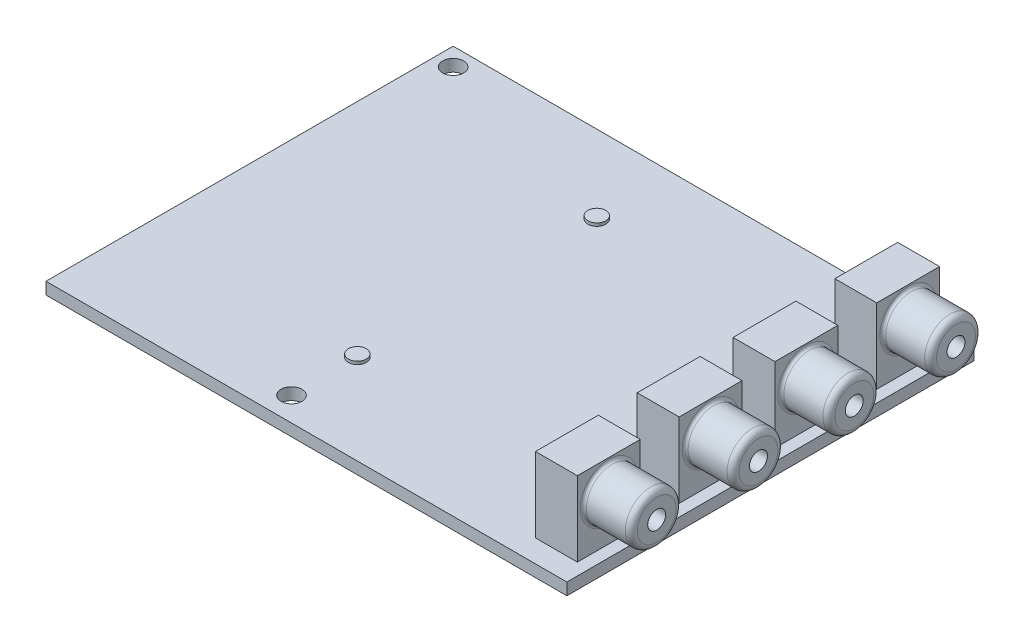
ISO-10303-21;
HEADER;
FILE_DESCRIPTION(('STEP AP214'),'2;1');
FILE_NAME('part.step','',(''),(''),'','','');
FILE_SCHEMA(('AUTOMOTIVE_DESIGN { 1 0 10303 214 1 1 1 1 }'));
ENDSEC;
DATA;
#1=APPLICATION_CONTEXT('core data for automotive mechanical design processes');
#2=APPLICATION_PROTOCOL_DEFINITION('international standard','automotive_design',2000,#1);
#3=PRODUCT_CONTEXT('',#1,'mechanical');
#4=PRODUCT('Part','Part','',(#3));
#5=PRODUCT_RELATED_PRODUCT_CATEGORY('part','',(#4));
#6=PRODUCT_DEFINITION_FORMATION('','',#4);
#7=PRODUCT_DEFINITION_CONTEXT('part definition',#1,'design');
#8=PRODUCT_DEFINITION('design','',#6,#7);
#9=PRODUCT_DEFINITION_SHAPE('','',#8);
#10=(LENGTH_UNIT() NAMED_UNIT(*) SI_UNIT(.MILLI.,.METRE.));
#11=(NAMED_UNIT(*) PLANE_ANGLE_UNIT() SI_UNIT($,.RADIAN.));
#12=(NAMED_UNIT(*) SI_UNIT($,.STERADIAN.) SOLID_ANGLE_UNIT());
#13=UNCERTAINTY_MEASURE_WITH_UNIT(LENGTH_MEASURE(1.E-05),#10,'distance_accuracy_value','');
#14=(GEOMETRIC_REPRESENTATION_CONTEXT(3) GLOBAL_UNCERTAINTY_ASSIGNED_CONTEXT((#13)) GLOBAL_UNIT_ASSIGNED_CONTEXT((#10,
#11,#12)) REPRESENTATION_CONTEXT('',''));
#15=CARTESIAN_POINT('',(0.,0.,0.));
#16=DIRECTION('',(0.,0.,1.));
#17=DIRECTION('',(1.,0.,0.));
#18=AXIS2_PLACEMENT_3D('',#15,#16,#17);
#19=CARTESIAN_POINT('',(0.,2.,0.));
#20=DIRECTION('',(0.,-1.,0.));
#21=DIRECTION('',(0.,0.,-1.));
#22=AXIS2_PLACEMENT_3D('',#19,#20,#21);
#23=PLANE('',#22);
#24=CARTESIAN_POINT('',(37.,2.,-15.));
#25=DIRECTION('',(0.,-1.,0.));
#26=DIRECTION('',(0.,0.,-1.));
#27=AXIS2_PLACEMENT_3D('',#24,#25,#26);
#28=CIRCLE('',#27,1.5);
#29=CARTESIAN_POINT('',(37.,2.,-16.5));
#30=VERTEX_POINT('',#29);
#31=EDGE_CURVE('E11',#30,#30,#28,.F.);
#32=ORIENTED_EDGE('',*,*,#31,.F.);
#33=EDGE_LOOP('',(#32));
#34=FACE_BOUND('',#33,.T.);
#35=CARTESIAN_POINT('',(37.,2.,-55.));
#36=DIRECTION('',(0.,-1.,0.));
#37=DIRECTION('',(0.,0.,-1.));
#38=AXIS2_PLACEMENT_3D('',#35,#36,#37);
#39=CIRCLE('',#38,1.5);
#40=CARTESIAN_POINT('',(37.,2.,-56.5));
#41=VERTEX_POINT('',#40);
#42=EDGE_CURVE('E47',#41,#41,#39,.F.);
#43=ORIENTED_EDGE('',*,*,#42,.F.);
#44=EDGE_LOOP('',(#43));
#45=FACE_BOUND('',#44,.T.);
#46=DIRECTION('',(0.,0.,-1.));
#47=VECTOR('',#46,1.);
#48=CARTESIAN_POINT('',(85.,2.,-31.25));
#49=LINE('',#48,#47);
#50=CARTESIAN_POINT('',(85.,2.,-20.75));
#51=VERTEX_POINT('',#50);
#52=CARTESIAN_POINT('',(85.,2.,-31.25));
#53=VERTEX_POINT('',#52);
#54=EDGE_CURVE('E229',#51,#53,#49,.T.);
#55=ORIENTED_EDGE('',*,*,#54,.F.);
#56=DIRECTION('',(1.,0.,0.));
#57=VECTOR('',#56,1.);
#58=CARTESIAN_POINT('',(78.,2.,-20.75));
#59=LINE('',#58,#57);
#60=CARTESIAN_POINT('',(78.,2.,-20.75));
#61=VERTEX_POINT('',#60);
#62=EDGE_CURVE('E219',#61,#51,#59,.T.);
#63=ORIENTED_EDGE('',*,*,#62,.F.);
#64=DIRECTION('',(0.,0.,1.));
#65=VECTOR('',#64,1.);
#66=CARTESIAN_POINT('',(78.,2.,-31.25));
#67=LINE('',#66,#65);
#68=CARTESIAN_POINT('',(78.,2.,-31.25));
#69=VERTEX_POINT('',#68);
#70=EDGE_CURVE('E222',#69,#61,#67,.T.);
#71=ORIENTED_EDGE('',*,*,#70,.F.);
#72=DIRECTION('',(-1.,0.,0.));
#73=VECTOR('',#72,1.);
#74=CARTESIAN_POINT('',(78.,2.,-31.25));
#75=LINE('',#74,#73);
#76=EDGE_CURVE('E226',#53,#69,#75,.T.);
#77=ORIENTED_EDGE('',*,*,#76,.F.);
#78=EDGE_LOOP('',(#55,#63,#71,#77));
#79=FACE_BOUND('',#78,.T.);
#80=DIRECTION('',(0.,0.,-1.));
#81=VECTOR('',#80,1.);
#82=CARTESIAN_POINT('',(85.,2.,-64.25));
#83=LINE('',#82,#81);
#84=CARTESIAN_POINT('',(85.,2.,-53.75));
#85=VERTEX_POINT('',#84);
#86=CARTESIAN_POINT('',(85.,2.,-64.25));
#87=VERTEX_POINT('',#86);
#88=EDGE_CURVE('E265',#85,#87,#83,.T.);
#89=ORIENTED_EDGE('',*,*,#88,.F.);
#90=DIRECTION('',(1.,0.,0.));
#91=VECTOR('',#90,1.);
#92=CARTESIAN_POINT('',(78.,2.,-53.75));
#93=LINE('',#92,#91);
#94=CARTESIAN_POINT('',(78.,2.,-53.75));
#95=VERTEX_POINT('',#94);
#96=EDGE_CURVE('E277',#95,#85,#93,.T.);
#97=ORIENTED_EDGE('',*,*,#96,.F.);
#98=DIRECTION('',(0.,0.,1.));
#99=VECTOR('',#98,1.);
#100=CARTESIAN_POINT('',(78.,2.,-64.25));
#101=LINE('',#100,#99);
#102=CARTESIAN_POINT('',(78.,2.,-64.25));
#103=VERTEX_POINT('',#102);
#104=EDGE_CURVE('E289',#103,#95,#101,.T.);
#105=ORIENTED_EDGE('',*,*,#104,.F.);
#106=DIRECTION('',(-1.,0.,0.));
#107=VECTOR('',#106,1.);
#108=CARTESIAN_POINT('',(78.,2.,-64.25));
#109=LINE('',#108,#107);
#110=EDGE_CURVE('E286',#87,#103,#109,.T.);
#111=ORIENTED_EDGE('',*,*,#110,.F.);
#112=EDGE_LOOP('',(#89,#97,#105,#111));
#113=FACE_BOUND('',#112,.T.);
#114=DIRECTION('',(0.,0.,1.));
#115=VECTOR('',#114,1.);
#116=CARTESIAN_POINT('',(0.,2.,0.));
#117=LINE('',#116,#115);
#118=CARTESIAN_POINT('',(0.,2.,-68.));
#119=VERTEX_POINT('',#118);
#120=CARTESIAN_POINT('',(0.,2.,0.));
#121=VERTEX_POINT('',#120);
#122=EDGE_CURVE('E330',#119,#121,#117,.T.);
#123=ORIENTED_EDGE('',*,*,#122,.T.);
#124=DIRECTION('',(1.,0.,0.));
#125=VECTOR('',#124,1.);
#126=CARTESIAN_POINT('',(0.,2.,0.));
#127=LINE('',#126,#125);
#128=CARTESIAN_POINT('',(87.,2.,0.));
#129=VERTEX_POINT('',#128);
#130=EDGE_CURVE('E333',#121,#129,#127,.T.);
#131=ORIENTED_EDGE('',*,*,#130,.T.);
#132=DIRECTION('',(0.,0.,-1.));
#133=VECTOR('',#132,1.);
#134=CARTESIAN_POINT('',(87.,2.,0.));
#135=LINE('',#134,#133);
#136=CARTESIAN_POINT('',(87.,2.,-68.));
#137=VERTEX_POINT('',#136);
#138=EDGE_CURVE('E336',#129,#137,#135,.T.);
#139=ORIENTED_EDGE('',*,*,#138,.T.);
#140=DIRECTION('',(-1.,0.,0.));
#141=VECTOR('',#140,1.);
#142=CARTESIAN_POINT('',(0.,2.,-68.));
#143=LINE('',#142,#141);
#144=EDGE_CURVE('E338',#137,#119,#143,.T.);
#145=ORIENTED_EDGE('',*,*,#144,.T.);
#146=EDGE_LOOP('',(#123,#131,#139,#145));
#147=FACE_BOUND('',#146,.T.);
#148=CARTESIAN_POINT('',(3.,2.,-65.));
#149=DIRECTION('',(0.,1.,0.));
#150=DIRECTION('',(0.,0.,1.));
#151=AXIS2_PLACEMENT_3D('',#148,#149,#150);
#152=CIRCLE('',#151,1.75);
#153=CARTESIAN_POINT('',(3.,2.,-63.25));
#154=VERTEX_POINT('',#153);
#155=EDGE_CURVE('E324',#154,#154,#152,.T.);
#156=ORIENTED_EDGE('',*,*,#155,.F.);
#157=EDGE_LOOP('',(#156));
#158=FACE_BOUND('',#157,.T.);
#159=CARTESIAN_POINT('',(37.,2.,-4.));
#160=DIRECTION('',(0.,1.,0.));
#161=DIRECTION('',(0.,0.,1.));
#162=AXIS2_PLACEMENT_3D('',#159,#160,#161);
#163=CIRCLE('',#162,1.75);
#164=CARTESIAN_POINT('',(37.,2.,-2.25));
#165=VERTEX_POINT('',#164);
#166=EDGE_CURVE('E318',#165,#165,#163,.T.);
#167=ORIENTED_EDGE('',*,*,#166,.F.);
#168=EDGE_LOOP('',(#167));
#169=FACE_BOUND('',#168,.T.);
#170=CARTESIAN_POINT('',(73.,2.,-51.));
#171=DIRECTION('',(0.,1.,0.));
#172=DIRECTION('',(0.,0.,1.));
#173=AXIS2_PLACEMENT_3D('',#170,#171,#172);
#174=CIRCLE('',#173,1.75);
#175=CARTESIAN_POINT('',(73.,2.,-49.25));
#176=VERTEX_POINT('',#175);
#177=EDGE_CURVE('E312',#176,#176,#174,.T.);
#178=ORIENTED_EDGE('',*,*,#177,.F.);
#179=EDGE_LOOP('',(#178));
#180=FACE_BOUND('',#179,.T.);
#181=CARTESIAN_POINT('',(73.,2.,-17.));
#182=DIRECTION('',(0.,1.,0.));
#183=DIRECTION('',(0.,0.,1.));
#184=AXIS2_PLACEMENT_3D('',#181,#182,#183);
#185=CIRCLE('',#184,1.75);
#186=CARTESIAN_POINT('',(73.,2.,-15.25));
#187=VERTEX_POINT('',#186);
#188=EDGE_CURVE('E306',#187,#187,#185,.T.);
#189=ORIENTED_EDGE('',*,*,#188,.F.);
#190=EDGE_LOOP('',(#189));
#191=FACE_BOUND('',#190,.T.);
#192=DIRECTION('',(0.,0.,-1.));
#193=VECTOR('',#192,1.);
#194=CARTESIAN_POINT('',(85.,2.,-47.25));
#195=LINE('',#194,#193);
#196=CARTESIAN_POINT('',(85.,2.,-36.75));
#197=VERTEX_POINT('',#196);
#198=CARTESIAN_POINT('',(85.,2.,-47.25));
#199=VERTEX_POINT('',#198);
#200=EDGE_CURVE('E262',#197,#199,#195,.T.);
#201=ORIENTED_EDGE('',*,*,#200,.F.);
#202=DIRECTION('',(1.,0.,0.));
#203=VECTOR('',#202,1.);
#204=CARTESIAN_POINT('',(78.,2.,-36.75));
#205=LINE('',#204,#203);
#206=CARTESIAN_POINT('',(78.,2.,-36.75));
#207=VERTEX_POINT('',#206);
#208=EDGE_CURVE('E252',#207,#197,#205,.T.);
#209=ORIENTED_EDGE('',*,*,#208,.F.);
#210=DIRECTION('',(0.,0.,1.));
#211=VECTOR('',#210,1.);
#212=CARTESIAN_POINT('',(78.,2.,-47.25));
#213=LINE('',#212,#211);
#214=CARTESIAN_POINT('',(78.,2.,-47.25));
#215=VERTEX_POINT('',#214);
#216=EDGE_CURVE('E255',#215,#207,#213,.T.);
#217=ORIENTED_EDGE('',*,*,#216,.F.);
#218=DIRECTION('',(-1.,0.,0.));
#219=VECTOR('',#218,1.);
#220=CARTESIAN_POINT('',(78.,2.,-47.25));
#221=LINE('',#220,#219);
#222=EDGE_CURVE('E259',#199,#215,#221,.T.);
#223=ORIENTED_EDGE('',*,*,#222,.F.);
#224=EDGE_LOOP('',(#201,#209,#217,#223));
#225=FACE_BOUND('',#224,.T.);
#226=DIRECTION('',(0.,0.,-1.));
#227=VECTOR('',#226,1.);
#228=CARTESIAN_POINT('',(85.,2.,-14.25));
#229=LINE('',#228,#227);
#230=CARTESIAN_POINT('',(85.,2.,-3.75000000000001));
#231=VERTEX_POINT('',#230);
#232=CARTESIAN_POINT('',(85.,2.,-14.25));
#233=VERTEX_POINT('',#232);
#234=EDGE_CURVE('E172',#231,#233,#229,.T.);
#235=ORIENTED_EDGE('',*,*,#234,.F.);
#236=DIRECTION('',(1.,0.,0.));
#237=VECTOR('',#236,1.);
#238=CARTESIAN_POINT('',(78.,2.,-3.75000000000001));
#239=LINE('',#238,#237);
#240=CARTESIAN_POINT('',(78.,2.,-3.75000000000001));
#241=VERTEX_POINT('',#240);
#242=EDGE_CURVE('E174',#241,#231,#239,.T.);
#243=ORIENTED_EDGE('',*,*,#242,.F.);
#244=DIRECTION('',(0.,0.,1.));
#245=VECTOR('',#244,1.);
#246=CARTESIAN_POINT('',(78.,2.,-14.25));
#247=LINE('',#246,#245);
#248=CARTESIAN_POINT('',(78.,2.,-14.25));
#249=VERTEX_POINT('',#248);
#250=EDGE_CURVE('E59',#249,#241,#247,.T.);
#251=ORIENTED_EDGE('',*,*,#250,.F.);
#252=DIRECTION('',(-1.,0.,0.));
#253=VECTOR('',#252,1.);
#254=CARTESIAN_POINT('',(78.,2.,-14.25));
#255=LINE('',#254,#253);
#256=EDGE_CURVE('E54',#233,#249,#255,.T.);
#257=ORIENTED_EDGE('',*,*,#256,.F.);
#258=EDGE_LOOP('',(#235,#243,#251,#257));
#259=FACE_BOUND('',#258,.T.);
#260=ADVANCED_FACE('F39',(#34,#45,#79,#113,#147,#158,#169,#180,#191,#225,#259),#23,.F.);
#261=CARTESIAN_POINT('',(0.,0.,0.));
#262=DIRECTION('',(0.,-1.,0.));
#263=DIRECTION('',(0.,0.,-1.));
#264=AXIS2_PLACEMENT_3D('',#261,#262,#263);
#265=PLANE('',#264);
#266=CARTESIAN_POINT('',(73.,0.,-51.));
#267=DIRECTION('',(0.,1.,0.));
#268=DIRECTION('',(0.,0.,1.));
#269=AXIS2_PLACEMENT_3D('',#266,#267,#268);
#270=CIRCLE('',#269,1.75);
#271=CARTESIAN_POINT('',(73.,0.,-49.25));
#272=VERTEX_POINT('',#271);
#273=EDGE_CURVE('E309',#272,#272,#270,.T.);
#274=ORIENTED_EDGE('',*,*,#273,.T.);
#275=EDGE_LOOP('',(#274));
#276=FACE_BOUND('',#275,.T.);
#277=CARTESIAN_POINT('',(3.,0.,-65.));
#278=DIRECTION('',(0.,1.,0.));
#279=DIRECTION('',(0.,0.,1.));
#280=AXIS2_PLACEMENT_3D('',#277,#278,#279);
#281=CIRCLE('',#280,1.75);
#282=CARTESIAN_POINT('',(3.,0.,-63.25));
#283=VERTEX_POINT('',#282);
#284=EDGE_CURVE('E321',#283,#283,#281,.T.);
#285=ORIENTED_EDGE('',*,*,#284,.T.);
#286=EDGE_LOOP('',(#285));
#287=FACE_BOUND('',#286,.T.);
#288=DIRECTION('',(0.,0.,1.));
#289=VECTOR('',#288,1.);
#290=CARTESIAN_POINT('',(0.,0.,0.));
#291=LINE('',#290,#289);
#292=CARTESIAN_POINT('',(0.,0.,-68.));
#293=VERTEX_POINT('',#292);
#294=CARTESIAN_POINT('',(0.,0.,0.));
#295=VERTEX_POINT('',#294);
#296=EDGE_CURVE('E327',#293,#295,#291,.T.);
#297=ORIENTED_EDGE('',*,*,#296,.F.);
#298=DIRECTION('',(-1.,0.,0.));
#299=VECTOR('',#298,1.);
#300=CARTESIAN_POINT('',(0.,0.,-68.));
#301=LINE('',#300,#299);
#302=CARTESIAN_POINT('',(87.,0.,-68.));
#303=VERTEX_POINT('',#302);
#304=EDGE_CURVE('E334',#303,#293,#301,.T.);
#305=ORIENTED_EDGE('',*,*,#304,.F.);
#306=DIRECTION('',(0.,0.,-1.));
#307=VECTOR('',#306,1.);
#308=CARTESIAN_POINT('',(87.,0.,0.));
#309=LINE('',#308,#307);
#310=CARTESIAN_POINT('',(87.,0.,0.));
#311=VERTEX_POINT('',#310);
#312=EDGE_CURVE('E345',#311,#303,#309,.T.);
#313=ORIENTED_EDGE('',*,*,#312,.F.);
#314=DIRECTION('',(1.,0.,0.));
#315=VECTOR('',#314,1.);
#316=CARTESIAN_POINT('',(0.,0.,0.));
#317=LINE('',#316,#315);
#318=EDGE_CURVE('E343',#295,#311,#317,.T.);
#319=ORIENTED_EDGE('',*,*,#318,.F.);
#320=EDGE_LOOP('',(#297,#305,#313,#319));
#321=FACE_BOUND('',#320,.T.);
#322=CARTESIAN_POINT('',(37.,0.,-4.));
#323=DIRECTION('',(0.,1.,0.));
#324=DIRECTION('',(0.,0.,1.));
#325=AXIS2_PLACEMENT_3D('',#322,#323,#324);
#326=CIRCLE('',#325,1.75);
#327=CARTESIAN_POINT('',(37.,0.,-2.25));
#328=VERTEX_POINT('',#327);
#329=EDGE_CURVE('E315',#328,#328,#326,.T.);
#330=ORIENTED_EDGE('',*,*,#329,.T.);
#331=EDGE_LOOP('',(#330));
#332=FACE_BOUND('',#331,.T.);
#333=CARTESIAN_POINT('',(73.,0.,-17.));
#334=DIRECTION('',(0.,1.,0.));
#335=DIRECTION('',(0.,0.,1.));
#336=AXIS2_PLACEMENT_3D('',#333,#334,#335);
#337=CIRCLE('',#336,1.75);
#338=CARTESIAN_POINT('',(73.,0.,-15.25));
#339=VERTEX_POINT('',#338);
#340=EDGE_CURVE('E305',#339,#339,#337,.T.);
#341=ORIENTED_EDGE('',*,*,#340,.T.);
#342=EDGE_LOOP('',(#341));
#343=FACE_BOUND('',#342,.T.);
#344=ADVANCED_FACE('F413',(#276,#287,#321,#332,#343),#265,.T.);
#345=CARTESIAN_POINT('',(0.,2.,0.));
#346=DIRECTION('',(1.,0.,0.));
#347=DIRECTION('',(0.,0.,-1.));
#348=AXIS2_PLACEMENT_3D('',#345,#346,#347);
#349=PLANE('',#348);
#350=ORIENTED_EDGE('',*,*,#296,.T.);
#351=DIRECTION('',(0.,-1.,0.));
#352=VECTOR('',#351,1.);
#353=CARTESIAN_POINT('',(0.,2.,0.));
#354=LINE('',#353,#352);
#355=EDGE_CURVE('E356',#121,#295,#354,.T.);
#356=ORIENTED_EDGE('',*,*,#355,.F.);
#357=ORIENTED_EDGE('',*,*,#122,.F.);
#358=DIRECTION('',(0.,-1.,0.));
#359=VECTOR('',#358,1.);
#360=CARTESIAN_POINT('',(0.,2.,-68.));
#361=LINE('',#360,#359);
#362=EDGE_CURVE('E340',#119,#293,#361,.T.);
#363=ORIENTED_EDGE('',*,*,#362,.T.);
#364=EDGE_LOOP('',(#350,#356,#357,#363));
#365=FACE_BOUND('',#364,.T.);
#366=ADVANCED_FACE('F503',(#365),#349,.F.);
#367=CARTESIAN_POINT('',(0.,2.,0.));
#368=DIRECTION('',(0.,0.,-1.));
#369=DIRECTION('',(-1.,0.,0.));
#370=AXIS2_PLACEMENT_3D('',#367,#368,#369);
#371=PLANE('',#370);
#372=ORIENTED_EDGE('',*,*,#318,.T.);
#373=DIRECTION('',(0.,-1.,0.));
#374=VECTOR('',#373,1.);
#375=CARTESIAN_POINT('',(87.,2.,0.));
#376=LINE('',#375,#374);
#377=EDGE_CURVE('E353',#129,#311,#376,.T.);
#378=ORIENTED_EDGE('',*,*,#377,.F.);
#379=ORIENTED_EDGE('',*,*,#130,.F.);
#380=ORIENTED_EDGE('',*,*,#355,.T.);
#381=EDGE_LOOP('',(#372,#378,#379,#380));
#382=FACE_BOUND('',#381,.T.);
#383=ADVANCED_FACE('F511',(#382),#371,.F.);
#384=CARTESIAN_POINT('',(87.,2.,0.));
#385=DIRECTION('',(-1.,0.,0.));
#386=DIRECTION('',(0.,0.,1.));
#387=AXIS2_PLACEMENT_3D('',#384,#385,#386);
#388=PLANE('',#387);
#389=ORIENTED_EDGE('',*,*,#312,.T.);
#390=DIRECTION('',(0.,-1.,0.));
#391=VECTOR('',#390,1.);
#392=CARTESIAN_POINT('',(87.,2.,-68.));
#393=LINE('',#392,#391);
#394=EDGE_CURVE('E350',#137,#303,#393,.T.);
#395=ORIENTED_EDGE('',*,*,#394,.F.);
#396=ORIENTED_EDGE('',*,*,#138,.F.);
#397=ORIENTED_EDGE('',*,*,#377,.T.);
#398=EDGE_LOOP('',(#389,#395,#396,#397));
#399=FACE_BOUND('',#398,.T.);
#400=ADVANCED_FACE('F507',(#399),#388,.F.);
#401=CARTESIAN_POINT('',(0.,2.,-68.));
#402=DIRECTION('',(0.,0.,1.));
#403=DIRECTION('',(1.,0.,0.));
#404=AXIS2_PLACEMENT_3D('',#401,#402,#403);
#405=PLANE('',#404);
#406=ORIENTED_EDGE('',*,*,#304,.T.);
#407=ORIENTED_EDGE('',*,*,#362,.F.);
#408=ORIENTED_EDGE('',*,*,#144,.F.);
#409=ORIENTED_EDGE('',*,*,#394,.T.);
#410=EDGE_LOOP('',(#406,#407,#408,#409));
#411=FACE_BOUND('',#410,.T.);
#412=ADVANCED_FACE('F498',(#411),#405,.F.);
#413=CARTESIAN_POINT('',(3.,2.,-65.));
#414=DIRECTION('',(0.,-1.,0.));
#415=DIRECTION('',(0.,0.,-1.));
#416=AXIS2_PLACEMENT_3D('',#413,#414,#415);
#417=CYLINDRICAL_SURFACE('',#416,1.75);
#418=ORIENTED_EDGE('',*,*,#155,.T.);
#419=EDGE_LOOP('',(#418));
#420=FACE_BOUND('',#419,.T.);
#421=ORIENTED_EDGE('',*,*,#284,.F.);
#422=EDGE_LOOP('',(#421));
#423=FACE_BOUND('',#422,.T.);
#424=ADVANCED_FACE('F495',(#420,#423),#417,.F.);
#425=CARTESIAN_POINT('',(37.,2.,-4.));
#426=DIRECTION('',(0.,-1.,0.));
#427=DIRECTION('',(0.,0.,-1.));
#428=AXIS2_PLACEMENT_3D('',#425,#426,#427);
#429=CYLINDRICAL_SURFACE('',#428,1.75);
#430=ORIENTED_EDGE('',*,*,#166,.T.);
#431=EDGE_LOOP('',(#430));
#432=FACE_BOUND('',#431,.T.);
#433=ORIENTED_EDGE('',*,*,#329,.F.);
#434=EDGE_LOOP('',(#433));
#435=FACE_BOUND('',#434,.T.);
#436=ADVANCED_FACE('F491',(#432,#435),#429,.F.);
#437=CARTESIAN_POINT('',(73.,2.,-51.));
#438=DIRECTION('',(0.,-1.,0.));
#439=DIRECTION('',(0.,0.,-1.));
#440=AXIS2_PLACEMENT_3D('',#437,#438,#439);
#441=CYLINDRICAL_SURFACE('',#440,1.75);
#442=ORIENTED_EDGE('',*,*,#177,.T.);
#443=EDGE_LOOP('',(#442));
#444=FACE_BOUND('',#443,.T.);
#445=ORIENTED_EDGE('',*,*,#273,.F.);
#446=EDGE_LOOP('',(#445));
#447=FACE_BOUND('',#446,.T.);
#448=ADVANCED_FACE('F487',(#444,#447),#441,.F.);
#449=CARTESIAN_POINT('',(73.,2.,-17.));
#450=DIRECTION('',(0.,-1.,0.));
#451=DIRECTION('',(0.,0.,-1.));
#452=AXIS2_PLACEMENT_3D('',#449,#450,#451);
#453=CYLINDRICAL_SURFACE('',#452,1.75);
#454=ORIENTED_EDGE('',*,*,#188,.T.);
#455=EDGE_LOOP('',(#454));
#456=FACE_BOUND('',#455,.T.);
#457=ORIENTED_EDGE('',*,*,#340,.F.);
#458=EDGE_LOOP('',(#457));
#459=FACE_BOUND('',#458,.T.);
#460=ADVANCED_FACE('F482',(#456,#459),#453,.F.);
#461=CARTESIAN_POINT('',(85.,14.5,-64.25));
#462=DIRECTION('',(-1.,0.,0.));
#463=DIRECTION('',(0.,0.,1.));
#464=AXIS2_PLACEMENT_3D('',#461,#462,#463);
#465=PLANE('',#464);
#466=CARTESIAN_POINT('',(85.,9.49999999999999,-59.));
#467=DIRECTION('',(-1.,0.,0.));
#468=DIRECTION('',(0.,0.,1.));
#469=AXIS2_PLACEMENT_3D('',#466,#467,#468);
#470=CIRCLE('',#469,4.75000000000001);
#471=CARTESIAN_POINT('',(85.,9.49999999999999,-54.25));
#472=VERTEX_POINT('',#471);
#473=EDGE_CURVE('E386',#472,#472,#470,.T.);
#474=ORIENTED_EDGE('',*,*,#473,.T.);
#475=EDGE_LOOP('',(#474));
#476=FACE_BOUND('',#475,.T.);
#477=ORIENTED_EDGE('',*,*,#88,.T.);
#478=DIRECTION('',(0.,-1.,0.));
#479=VECTOR('',#478,1.);
#480=CARTESIAN_POINT('',(85.,14.5,-64.25));
#481=LINE('',#480,#479);
#482=CARTESIAN_POINT('',(85.,14.5,-64.25));
#483=VERTEX_POINT('',#482);
#484=EDGE_CURVE('E302',#483,#87,#481,.T.);
#485=ORIENTED_EDGE('',*,*,#484,.F.);
#486=DIRECTION('',(0.,0.,-1.));
#487=VECTOR('',#486,1.);
#488=CARTESIAN_POINT('',(85.,14.5,-64.25));
#489=LINE('',#488,#487);
#490=CARTESIAN_POINT('',(85.,14.5,-53.75));
#491=VERTEX_POINT('',#490);
#492=EDGE_CURVE('E273',#491,#483,#489,.T.);
#493=ORIENTED_EDGE('',*,*,#492,.F.);
#494=DIRECTION('',(0.,-1.,0.));
#495=VECTOR('',#494,1.);
#496=CARTESIAN_POINT('',(85.,14.5,-53.75));
#497=LINE('',#496,#495);
#498=EDGE_CURVE('E283',#491,#85,#497,.T.);
#499=ORIENTED_EDGE('',*,*,#498,.T.);
#500=EDGE_LOOP('',(#477,#485,#493,#499));
#501=FACE_BOUND('',#500,.T.);
#502=ADVANCED_FACE('F478',(#476,#501),#465,.F.);
#503=CARTESIAN_POINT('',(78.,14.5,-64.25));
#504=DIRECTION('',(0.,0.,1.));
#505=DIRECTION('',(1.,0.,0.));
#506=AXIS2_PLACEMENT_3D('',#503,#504,#505);
#507=PLANE('',#506);
#508=ORIENTED_EDGE('',*,*,#110,.T.);
#509=DIRECTION('',(0.,-1.,0.));
#510=VECTOR('',#509,1.);
#511=CARTESIAN_POINT('',(78.,14.5,-64.25));
#512=LINE('',#511,#510);
#513=CARTESIAN_POINT('',(78.,14.5,-64.25));
#514=VERTEX_POINT('',#513);
#515=EDGE_CURVE('E299',#514,#103,#512,.T.);
#516=ORIENTED_EDGE('',*,*,#515,.F.);
#517=DIRECTION('',(-1.,0.,0.));
#518=VECTOR('',#517,1.);
#519=CARTESIAN_POINT('',(78.,14.5,-64.25));
#520=LINE('',#519,#518);
#521=EDGE_CURVE('E276',#483,#514,#520,.T.);
#522=ORIENTED_EDGE('',*,*,#521,.F.);
#523=ORIENTED_EDGE('',*,*,#484,.T.);
#524=EDGE_LOOP('',(#508,#516,#522,#523));
#525=FACE_BOUND('',#524,.T.);
#526=ADVANCED_FACE('F474',(#525),#507,.F.);
#527=CARTESIAN_POINT('',(78.,14.5,-64.25));
#528=DIRECTION('',(1.,0.,0.));
#529=DIRECTION('',(0.,0.,-1.));
#530=AXIS2_PLACEMENT_3D('',#527,#528,#529);
#531=PLANE('',#530);
#532=ORIENTED_EDGE('',*,*,#104,.T.);
#533=DIRECTION('',(0.,-1.,0.));
#534=VECTOR('',#533,1.);
#535=CARTESIAN_POINT('',(78.,14.5,-53.75));
#536=LINE('',#535,#534);
#537=CARTESIAN_POINT('',(78.,14.5,-53.75));
#538=VERTEX_POINT('',#537);
#539=EDGE_CURVE('E296',#538,#95,#536,.T.);
#540=ORIENTED_EDGE('',*,*,#539,.F.);
#541=DIRECTION('',(0.,0.,1.));
#542=VECTOR('',#541,1.);
#543=CARTESIAN_POINT('',(78.,14.5,-64.25));
#544=LINE('',#543,#542);
#545=EDGE_CURVE('E279',#514,#538,#544,.T.);
#546=ORIENTED_EDGE('',*,*,#545,.F.);
#547=ORIENTED_EDGE('',*,*,#515,.T.);
#548=EDGE_LOOP('',(#532,#540,#546,#547));
#549=FACE_BOUND('',#548,.T.);
#550=ADVANCED_FACE('F470',(#549),#531,.F.);
#551=CARTESIAN_POINT('',(78.,14.5,-53.75));
#552=DIRECTION('',(0.,0.,-1.));
#553=DIRECTION('',(-1.,0.,0.));
#554=AXIS2_PLACEMENT_3D('',#551,#552,#553);
#555=PLANE('',#554);
#556=ORIENTED_EDGE('',*,*,#96,.T.);
#557=ORIENTED_EDGE('',*,*,#498,.F.);
#558=DIRECTION('',(1.,0.,0.));
#559=VECTOR('',#558,1.);
#560=CARTESIAN_POINT('',(78.,14.5,-53.75));
#561=LINE('',#560,#559);
#562=EDGE_CURVE('E281',#538,#491,#561,.T.);
#563=ORIENTED_EDGE('',*,*,#562,.F.);
#564=ORIENTED_EDGE('',*,*,#539,.T.);
#565=EDGE_LOOP('',(#556,#557,#563,#564));
#566=FACE_BOUND('',#565,.T.);
#567=ADVANCED_FACE('F466',(#566),#555,.F.);
#568=CARTESIAN_POINT('',(0.,14.5,0.));
#569=DIRECTION('',(0.,1.,0.));
#570=DIRECTION('',(0.,0.,1.));
#571=AXIS2_PLACEMENT_3D('',#568,#569,#570);
#572=PLANE('',#571);
#573=ORIENTED_EDGE('',*,*,#492,.T.);
#574=ORIENTED_EDGE('',*,*,#521,.T.);
#575=ORIENTED_EDGE('',*,*,#545,.T.);
#576=ORIENTED_EDGE('',*,*,#562,.T.);
#577=EDGE_LOOP('',(#573,#574,#575,#576));
#578=FACE_BOUND('',#577,.T.);
#579=ADVANCED_FACE('F454',(#578),#572,.T.);
#580=CARTESIAN_POINT('',(85.,14.5,-47.25));
#581=DIRECTION('',(-1.,0.,0.));
#582=DIRECTION('',(0.,0.,1.));
#583=AXIS2_PLACEMENT_3D('',#580,#581,#582);
#584=PLANE('',#583);
#585=CARTESIAN_POINT('',(85.,9.49999999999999,-42.));
#586=DIRECTION('',(-1.,0.,0.));
#587=DIRECTION('',(0.,0.,1.));
#588=AXIS2_PLACEMENT_3D('',#585,#586,#587);
#589=CIRCLE('',#588,4.75);
#590=CARTESIAN_POINT('',(85.,9.49999999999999,-37.25));
#591=VERTEX_POINT('',#590);
#592=EDGE_CURVE('E392',#591,#591,#589,.T.);
#593=ORIENTED_EDGE('',*,*,#592,.T.);
#594=EDGE_LOOP('',(#593));
#595=FACE_BOUND('',#594,.T.);
#596=ORIENTED_EDGE('',*,*,#200,.T.);
#597=DIRECTION('',(0.,-1.,0.));
#598=VECTOR('',#597,1.);
#599=CARTESIAN_POINT('',(85.,14.5,-47.25));
#600=LINE('',#599,#598);
#601=CARTESIAN_POINT('',(85.,14.5,-47.25));
#602=VERTEX_POINT('',#601);
#603=EDGE_CURVE('E232',#602,#199,#600,.T.);
#604=ORIENTED_EDGE('',*,*,#603,.F.);
#605=DIRECTION('',(0.,0.,-1.));
#606=VECTOR('',#605,1.);
#607=CARTESIAN_POINT('',(85.,14.5,-47.25));
#608=LINE('',#607,#606);
#609=CARTESIAN_POINT('',(85.,14.5,-36.75));
#610=VERTEX_POINT('',#609);
#611=EDGE_CURVE('E256',#610,#602,#608,.T.);
#612=ORIENTED_EDGE('',*,*,#611,.F.);
#613=DIRECTION('',(0.,-1.,0.));
#614=VECTOR('',#613,1.);
#615=CARTESIAN_POINT('',(85.,14.5,-36.75));
#616=LINE('',#615,#614);
#617=EDGE_CURVE('E248',#610,#197,#616,.T.);
#618=ORIENTED_EDGE('',*,*,#617,.T.);
#619=EDGE_LOOP('',(#596,#604,#612,#618));
#620=FACE_BOUND('',#619,.T.);
#621=ADVANCED_FACE('F437',(#595,#620),#584,.F.);
#622=CARTESIAN_POINT('',(78.,14.5,-47.25));
#623=DIRECTION('',(0.,0.,1.));
#624=DIRECTION('',(1.,0.,0.));
#625=AXIS2_PLACEMENT_3D('',#622,#623,#624);
#626=PLANE('',#625);
#627=ORIENTED_EDGE('',*,*,#222,.T.);
#628=DIRECTION('',(0.,-1.,0.));
#629=VECTOR('',#628,1.);
#630=CARTESIAN_POINT('',(78.,14.5,-47.25));
#631=LINE('',#630,#629);
#632=CARTESIAN_POINT('',(78.,14.5,-47.25));
#633=VERTEX_POINT('',#632);
#634=EDGE_CURVE('E242',#633,#215,#631,.T.);
#635=ORIENTED_EDGE('',*,*,#634,.F.);
#636=DIRECTION('',(-1.,0.,0.));
#637=VECTOR('',#636,1.);
#638=CARTESIAN_POINT('',(78.,14.5,-47.25));
#639=LINE('',#638,#637);
#640=EDGE_CURVE('E269',#602,#633,#639,.T.);
#641=ORIENTED_EDGE('',*,*,#640,.F.);
#642=ORIENTED_EDGE('',*,*,#603,.T.);
#643=EDGE_LOOP('',(#627,#635,#641,#642));
#644=FACE_BOUND('',#643,.T.);
#645=ADVANCED_FACE('F445',(#644),#626,.F.);
#646=CARTESIAN_POINT('',(78.,14.5,-47.25));
#647=DIRECTION('',(1.,0.,0.));
#648=DIRECTION('',(0.,0.,-1.));
#649=AXIS2_PLACEMENT_3D('',#646,#647,#648);
#650=PLANE('',#649);
#651=ORIENTED_EDGE('',*,*,#216,.T.);
#652=DIRECTION('',(0.,-1.,0.));
#653=VECTOR('',#652,1.);
#654=CARTESIAN_POINT('',(78.,14.5,-36.75));
#655=LINE('',#654,#653);
#656=CARTESIAN_POINT('',(78.,14.5,-36.75));
#657=VERTEX_POINT('',#656);
#658=EDGE_CURVE('E245',#657,#207,#655,.T.);
#659=ORIENTED_EDGE('',*,*,#658,.F.);
#660=DIRECTION('',(0.,0.,1.));
#661=VECTOR('',#660,1.);
#662=CARTESIAN_POINT('',(78.,14.5,-47.25));
#663=LINE('',#662,#661);
#664=EDGE_CURVE('E267',#633,#657,#663,.T.);
#665=ORIENTED_EDGE('',*,*,#664,.F.);
#666=ORIENTED_EDGE('',*,*,#634,.T.);
#667=EDGE_LOOP('',(#651,#659,#665,#666));
#668=FACE_BOUND('',#667,.T.);
#669=ADVANCED_FACE('F443',(#668),#650,.F.);
#670=CARTESIAN_POINT('',(78.,14.5,-36.75));
#671=DIRECTION('',(0.,0.,-1.));
#672=DIRECTION('',(-1.,0.,0.));
#673=AXIS2_PLACEMENT_3D('',#670,#671,#672);
#674=PLANE('',#673);
#675=ORIENTED_EDGE('',*,*,#208,.T.);
#676=ORIENTED_EDGE('',*,*,#617,.F.);
#677=DIRECTION('',(1.,0.,0.));
#678=VECTOR('',#677,1.);
#679=CARTESIAN_POINT('',(78.,14.5,-36.75));
#680=LINE('',#679,#678);
#681=EDGE_CURVE('E251',#657,#610,#680,.T.);
#682=ORIENTED_EDGE('',*,*,#681,.F.);
#683=ORIENTED_EDGE('',*,*,#658,.T.);
#684=EDGE_LOOP('',(#675,#676,#682,#683));
#685=FACE_BOUND('',#684,.T.);
#686=ADVANCED_FACE('F433',(#685),#674,.F.);
#687=CARTESIAN_POINT('',(0.,14.5,0.));
#688=DIRECTION('',(0.,1.,0.));
#689=DIRECTION('',(0.,0.,1.));
#690=AXIS2_PLACEMENT_3D('',#687,#688,#689);
#691=PLANE('',#690);
#692=ORIENTED_EDGE('',*,*,#611,.T.);
#693=ORIENTED_EDGE('',*,*,#640,.T.);
#694=ORIENTED_EDGE('',*,*,#664,.T.);
#695=ORIENTED_EDGE('',*,*,#681,.T.);
#696=EDGE_LOOP('',(#692,#693,#694,#695));
#697=FACE_BOUND('',#696,.T.);
#698=ADVANCED_FACE('F439',(#697),#691,.T.);
#699=CARTESIAN_POINT('',(85.,14.5,-31.25));
#700=DIRECTION('',(-1.,0.,0.));
#701=DIRECTION('',(0.,0.,1.));
#702=AXIS2_PLACEMENT_3D('',#699,#700,#701);
#703=PLANE('',#702);
#704=CARTESIAN_POINT('',(85.,9.49999999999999,-26.));
#705=DIRECTION('',(-1.,0.,0.));
#706=DIRECTION('',(0.,0.,1.));
#707=AXIS2_PLACEMENT_3D('',#704,#705,#706);
#708=CIRCLE('',#707,4.75000000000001);
#709=CARTESIAN_POINT('',(85.,9.49999999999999,-21.25));
#710=VERTEX_POINT('',#709);
#711=EDGE_CURVE('E398',#710,#710,#708,.T.);
#712=ORIENTED_EDGE('',*,*,#711,.T.);
#713=EDGE_LOOP('',(#712));
#714=FACE_BOUND('',#713,.T.);
#715=ORIENTED_EDGE('',*,*,#54,.T.);
#716=DIRECTION('',(0.,-1.,0.));
#717=VECTOR('',#716,1.);
#718=CARTESIAN_POINT('',(85.,14.5,-31.25));
#719=LINE('',#718,#717);
#720=CARTESIAN_POINT('',(85.,14.5,-31.25));
#721=VERTEX_POINT('',#720);
#722=EDGE_CURVE('E178',#721,#53,#719,.T.);
#723=ORIENTED_EDGE('',*,*,#722,.F.);
#724=DIRECTION('',(0.,0.,-1.));
#725=VECTOR('',#724,1.);
#726=CARTESIAN_POINT('',(85.,14.5,-31.25));
#727=LINE('',#726,#725);
#728=CARTESIAN_POINT('',(85.,14.5,-20.75));
#729=VERTEX_POINT('',#728);
#730=EDGE_CURVE('E223',#729,#721,#727,.T.);
#731=ORIENTED_EDGE('',*,*,#730,.F.);
#732=DIRECTION('',(0.,-1.,0.));
#733=VECTOR('',#732,1.);
#734=CARTESIAN_POINT('',(85.,14.5,-20.75));
#735=LINE('',#734,#733);
#736=EDGE_CURVE('E215',#729,#51,#735,.T.);
#737=ORIENTED_EDGE('',*,*,#736,.T.);
#738=EDGE_LOOP('',(#715,#723,#731,#737));
#739=FACE_BOUND('',#738,.T.);
#740=ADVANCED_FACE('F464',(#714,#739),#703,.F.);
#741=CARTESIAN_POINT('',(78.,14.5,-31.25));
#742=DIRECTION('',(0.,0.,1.));
#743=DIRECTION('',(1.,0.,0.));
#744=AXIS2_PLACEMENT_3D('',#741,#742,#743);
#745=PLANE('',#744);
#746=ORIENTED_EDGE('',*,*,#76,.T.);
#747=DIRECTION('',(0.,-1.,0.));
#748=VECTOR('',#747,1.);
#749=CARTESIAN_POINT('',(78.,14.5,-31.25));
#750=LINE('',#749,#748);
#751=CARTESIAN_POINT('',(78.,14.5,-31.25));
#752=VERTEX_POINT('',#751);
#753=EDGE_CURVE('E209',#752,#69,#750,.T.);
#754=ORIENTED_EDGE('',*,*,#753,.F.);
#755=DIRECTION('',(-1.,0.,0.));
#756=VECTOR('',#755,1.);
#757=CARTESIAN_POINT('',(78.,14.5,-31.25));
#758=LINE('',#757,#756);
#759=EDGE_CURVE('E236',#721,#752,#758,.T.);
#760=ORIENTED_EDGE('',*,*,#759,.F.);
#761=ORIENTED_EDGE('',*,*,#722,.T.);
#762=EDGE_LOOP('',(#746,#754,#760,#761));
#763=FACE_BOUND('',#762,.T.);
#764=ADVANCED_FACE('F613',(#763),#745,.F.);
#765=CARTESIAN_POINT('',(78.,14.5,-31.25));
#766=DIRECTION('',(1.,0.,0.));
#767=DIRECTION('',(0.,0.,-1.));
#768=AXIS2_PLACEMENT_3D('',#765,#766,#767);
#769=PLANE('',#768);
#770=ORIENTED_EDGE('',*,*,#70,.T.);
#771=DIRECTION('',(0.,-1.,0.));
#772=VECTOR('',#771,1.);
#773=CARTESIAN_POINT('',(78.,14.5,-20.75));
#774=LINE('',#773,#772);
#775=CARTESIAN_POINT('',(78.,14.5,-20.75));
#776=VERTEX_POINT('',#775);
#777=EDGE_CURVE('E212',#776,#61,#774,.T.);
#778=ORIENTED_EDGE('',*,*,#777,.F.);
#779=DIRECTION('',(0.,0.,1.));
#780=VECTOR('',#779,1.);
#781=CARTESIAN_POINT('',(78.,14.5,-31.25));
#782=LINE('',#781,#780);
#783=EDGE_CURVE('E234',#752,#776,#782,.T.);
#784=ORIENTED_EDGE('',*,*,#783,.F.);
#785=ORIENTED_EDGE('',*,*,#753,.T.);
#786=EDGE_LOOP('',(#770,#778,#784,#785));
#787=FACE_BOUND('',#786,.T.);
#788=ADVANCED_FACE('F618',(#787),#769,.F.);
#789=CARTESIAN_POINT('',(78.,14.5,-20.75));
#790=DIRECTION('',(0.,0.,-1.));
#791=DIRECTION('',(-1.,0.,0.));
#792=AXIS2_PLACEMENT_3D('',#789,#790,#791);
#793=PLANE('',#792);
#794=ORIENTED_EDGE('',*,*,#62,.T.);
#795=ORIENTED_EDGE('',*,*,#736,.F.);
#796=DIRECTION('',(1.,0.,0.));
#797=VECTOR('',#796,1.);
#798=CARTESIAN_POINT('',(78.,14.5,-20.75));
#799=LINE('',#798,#797);
#800=EDGE_CURVE('E218',#776,#729,#799,.T.);
#801=ORIENTED_EDGE('',*,*,#800,.F.);
#802=ORIENTED_EDGE('',*,*,#777,.T.);
#803=EDGE_LOOP('',(#794,#795,#801,#802));
#804=FACE_BOUND('',#803,.T.);
#805=ADVANCED_FACE('F622',(#804),#793,.F.);
#806=CARTESIAN_POINT('',(0.,14.5,0.));
#807=DIRECTION('',(0.,1.,0.));
#808=DIRECTION('',(0.,0.,1.));
#809=AXIS2_PLACEMENT_3D('',#806,#807,#808);
#810=PLANE('',#809);
#811=ORIENTED_EDGE('',*,*,#730,.T.);
#812=ORIENTED_EDGE('',*,*,#759,.T.);
#813=ORIENTED_EDGE('',*,*,#783,.T.);
#814=ORIENTED_EDGE('',*,*,#800,.T.);
#815=EDGE_LOOP('',(#811,#812,#813,#814));
#816=FACE_BOUND('',#815,.T.);
#817=ADVANCED_FACE('F625',(#816),#810,.T.);
#818=CARTESIAN_POINT('',(85.,14.5,-14.25));
#819=DIRECTION('',(-1.,0.,0.));
#820=DIRECTION('',(0.,0.,1.));
#821=AXIS2_PLACEMENT_3D('',#818,#819,#820);
#822=PLANE('',#821);
#823=CARTESIAN_POINT('',(85.,9.49999999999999,-9.00000000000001));
#824=DIRECTION('',(-1.,0.,0.));
#825=DIRECTION('',(0.,0.,1.));
#826=AXIS2_PLACEMENT_3D('',#823,#824,#825);
#827=CIRCLE('',#826,4.75);
#828=CARTESIAN_POINT('',(85.,9.49999999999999,-4.25000000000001));
#829=VERTEX_POINT('',#828);
#830=EDGE_CURVE('E404',#829,#829,#827,.T.);
#831=ORIENTED_EDGE('',*,*,#830,.T.);
#832=EDGE_LOOP('',(#831));
#833=FACE_BOUND('',#832,.T.);
#834=ORIENTED_EDGE('',*,*,#234,.T.);
#835=DIRECTION('',(0.,-1.,0.));
#836=VECTOR('',#835,1.);
#837=CARTESIAN_POINT('',(85.,14.5,-14.25));
#838=LINE('',#837,#836);
#839=CARTESIAN_POINT('',(85.,14.5,-14.25));
#840=VERTEX_POINT('',#839);
#841=EDGE_CURVE('E585',#840,#233,#838,.T.);
#842=ORIENTED_EDGE('',*,*,#841,.F.);
#843=DIRECTION('',(0.,0.,-1.));
#844=VECTOR('',#843,1.);
#845=CARTESIAN_POINT('',(85.,14.5,-14.25));
#846=LINE('',#845,#844);
#847=CARTESIAN_POINT('',(85.,14.5,-3.75000000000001));
#848=VERTEX_POINT('',#847);
#849=EDGE_CURVE('E189',#848,#840,#846,.T.);
#850=ORIENTED_EDGE('',*,*,#849,.F.);
#851=DIRECTION('',(0.,-1.,0.));
#852=VECTOR('',#851,1.);
#853=CARTESIAN_POINT('',(85.,14.5,-3.75000000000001));
#854=LINE('',#853,#852);
#855=EDGE_CURVE('E185',#848,#231,#854,.T.);
#856=ORIENTED_EDGE('',*,*,#855,.T.);
#857=EDGE_LOOP('',(#834,#842,#850,#856));
#858=FACE_BOUND('',#857,.T.);
#859=ADVANCED_FACE('F191',(#833,#858),#822,.F.);
#860=CARTESIAN_POINT('',(78.,14.5,-14.25));
#861=DIRECTION('',(0.,0.,1.));
#862=DIRECTION('',(1.,0.,0.));
#863=AXIS2_PLACEMENT_3D('',#860,#861,#862);
#864=PLANE('',#863);
#865=ORIENTED_EDGE('',*,*,#256,.T.);
#866=DIRECTION('',(0.,-1.,0.));
#867=VECTOR('',#866,1.);
#868=CARTESIAN_POINT('',(78.,14.5,-14.25));
#869=LINE('',#868,#867);
#870=CARTESIAN_POINT('',(78.,14.5,-14.25));
#871=VERTEX_POINT('',#870);
#872=EDGE_CURVE('E197',#871,#249,#869,.T.);
#873=ORIENTED_EDGE('',*,*,#872,.F.);
#874=DIRECTION('',(-1.,0.,0.));
#875=VECTOR('',#874,1.);
#876=CARTESIAN_POINT('',(78.,14.5,-14.25));
#877=LINE('',#876,#875);
#878=EDGE_CURVE('E204',#840,#871,#877,.T.);
#879=ORIENTED_EDGE('',*,*,#878,.F.);
#880=ORIENTED_EDGE('',*,*,#841,.T.);
#881=EDGE_LOOP('',(#865,#873,#879,#880));
#882=FACE_BOUND('',#881,.T.);
#883=ADVANCED_FACE('F594',(#882),#864,.F.);
#884=CARTESIAN_POINT('',(78.,14.5,-14.25));
#885=DIRECTION('',(1.,0.,0.));
#886=DIRECTION('',(0.,0.,-1.));
#887=AXIS2_PLACEMENT_3D('',#884,#885,#886);
#888=PLANE('',#887);
#889=ORIENTED_EDGE('',*,*,#250,.T.);
#890=DIRECTION('',(0.,-1.,0.));
#891=VECTOR('',#890,1.);
#892=CARTESIAN_POINT('',(78.,14.5,-3.75000000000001));
#893=LINE('',#892,#891);
#894=CARTESIAN_POINT('',(78.,14.5,-3.75000000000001));
#895=VERTEX_POINT('',#894);
#896=EDGE_CURVE('E188',#895,#241,#893,.T.);
#897=ORIENTED_EDGE('',*,*,#896,.F.);
#898=DIRECTION('',(0.,0.,1.));
#899=VECTOR('',#898,1.);
#900=CARTESIAN_POINT('',(78.,14.5,-14.25));
#901=LINE('',#900,#899);
#902=EDGE_CURVE('E195',#871,#895,#901,.T.);
#903=ORIENTED_EDGE('',*,*,#902,.F.);
#904=ORIENTED_EDGE('',*,*,#872,.T.);
#905=EDGE_LOOP('',(#889,#897,#903,#904));
#906=FACE_BOUND('',#905,.T.);
#907=ADVANCED_FACE('F592',(#906),#888,.F.);
#908=CARTESIAN_POINT('',(78.,14.5,-3.75000000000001));
#909=DIRECTION('',(0.,0.,-1.));
#910=DIRECTION('',(-1.,0.,0.));
#911=AXIS2_PLACEMENT_3D('',#908,#909,#910);
#912=PLANE('',#911);
#913=ORIENTED_EDGE('',*,*,#242,.T.);
#914=ORIENTED_EDGE('',*,*,#855,.F.);
#915=DIRECTION('',(1.,0.,0.));
#916=VECTOR('',#915,1.);
#917=CARTESIAN_POINT('',(78.,14.5,-3.75000000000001));
#918=LINE('',#917,#916);
#919=EDGE_CURVE('E193',#895,#848,#918,.T.);
#920=ORIENTED_EDGE('',*,*,#919,.F.);
#921=ORIENTED_EDGE('',*,*,#896,.T.);
#922=EDGE_LOOP('',(#913,#914,#920,#921));
#923=FACE_BOUND('',#922,.T.);
#924=ADVANCED_FACE('F183',(#923),#912,.F.);
#925=CARTESIAN_POINT('',(0.,14.5,0.));
#926=DIRECTION('',(0.,1.,0.));
#927=DIRECTION('',(0.,0.,1.));
#928=AXIS2_PLACEMENT_3D('',#925,#926,#927);
#929=PLANE('',#928);
#930=ORIENTED_EDGE('',*,*,#849,.T.);
#931=ORIENTED_EDGE('',*,*,#878,.T.);
#932=ORIENTED_EDGE('',*,*,#902,.T.);
#933=ORIENTED_EDGE('',*,*,#919,.T.);
#934=EDGE_LOOP('',(#930,#931,#932,#933));
#935=FACE_BOUND('',#934,.T.);
#936=ADVANCED_FACE('F596',(#935),#929,.T.);
#937=CARTESIAN_POINT('',(93.,9.49999999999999,-9.00000000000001));
#938=DIRECTION('',(1.,0.,0.));
#939=DIRECTION('',(0.,0.,-1.));
#940=AXIS2_PLACEMENT_3D('',#937,#938,#939);
#941=PLANE('',#940);
#942=CARTESIAN_POINT('',(93.,9.49999999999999,-9.00000000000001));
#943=DIRECTION('',(1.,0.,0.));
#944=DIRECTION('',(0.,0.,-1.));
#945=AXIS2_PLACEMENT_3D('',#942,#943,#944);
#946=CIRCLE('',#945,3.25);
#947=CARTESIAN_POINT('',(93.,9.49999999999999,-12.25));
#948=VERTEX_POINT('',#947);
#949=EDGE_CURVE('E377',#948,#948,#946,.T.);
#950=ORIENTED_EDGE('',*,*,#949,.T.);
#951=EDGE_LOOP('',(#950));
#952=FACE_BOUND('',#951,.T.);
#953=CARTESIAN_POINT('',(93.,9.49999999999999,-9.00000000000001));
#954=DIRECTION('',(1.,0.,0.));
#955=DIRECTION('',(0.,0.,-1.));
#956=AXIS2_PLACEMENT_3D('',#953,#954,#955);
#957=CIRCLE('',#956,1.5);
#958=CARTESIAN_POINT('',(93.,9.49999999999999,-10.5));
#959=VERTEX_POINT('',#958);
#960=EDGE_CURVE('E582',#959,#959,#957,.T.);
#961=ORIENTED_EDGE('',*,*,#960,.F.);
#962=EDGE_LOOP('',(#961));
#963=FACE_BOUND('',#962,.T.);
#964=ADVANCED_FACE('F598',(#952,#963),#941,.T.);
#965=CARTESIAN_POINT('',(93.,9.49999999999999,-9.00000000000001));
#966=DIRECTION('',(-1.,0.,0.));
#967=DIRECTION('',(0.,0.,1.));
#968=AXIS2_PLACEMENT_3D('',#965,#966,#967);
#969=CYLINDRICAL_SURFACE('',#968,4.25);
#970=CARTESIAN_POINT('',(85.5,9.49999999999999,-9.00000000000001));
#971=DIRECTION('',(-1.,0.,0.));
#972=DIRECTION('',(0.,0.,1.));
#973=AXIS2_PLACEMENT_3D('',#970,#971,#972);
#974=CIRCLE('',#973,4.25);
#975=CARTESIAN_POINT('',(85.5,9.49999999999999,-4.75000000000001));
#976=VERTEX_POINT('',#975);
#977=EDGE_CURVE('E401',#976,#976,#974,.F.);
#978=ORIENTED_EDGE('',*,*,#977,.T.);
#979=EDGE_LOOP('',(#978));
#980=FACE_BOUND('',#979,.T.);
#981=CARTESIAN_POINT('',(92.,9.49999999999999,-9.00000000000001));
#982=DIRECTION('',(1.,0.,0.));
#983=DIRECTION('',(0.,0.,-1.));
#984=AXIS2_PLACEMENT_3D('',#981,#982,#983);
#985=CIRCLE('',#984,4.25);
#986=CARTESIAN_POINT('',(92.,9.49999999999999,-13.25));
#987=VERTEX_POINT('',#986);
#988=EDGE_CURVE('E380',#987,#987,#985,.F.);
#989=ORIENTED_EDGE('',*,*,#988,.T.);
#990=EDGE_LOOP('',(#989));
#991=FACE_BOUND('',#990,.T.);
#992=ADVANCED_FACE('F605',(#980,#991),#969,.T.);
#993=CARTESIAN_POINT('',(93.,9.49999999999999,-9.00000000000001));
#994=DIRECTION('',(-1.,0.,0.));
#995=DIRECTION('',(0.,0.,1.));
#996=AXIS2_PLACEMENT_3D('',#993,#994,#995);
#997=CYLINDRICAL_SURFACE('',#996,1.5);
#998=ORIENTED_EDGE('',*,*,#960,.T.);
#999=EDGE_LOOP('',(#998));
#1000=FACE_BOUND('',#999,.T.);
#1001=CARTESIAN_POINT('',(85.,9.49999999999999,-9.00000000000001));
#1002=DIRECTION('',(1.,0.,0.));
#1003=DIRECTION('',(0.,0.,-1.));
#1004=AXIS2_PLACEMENT_3D('',#1001,#1002,#1003);
#1005=CIRCLE('',#1004,1.5);
#1006=CARTESIAN_POINT('',(85.,9.49999999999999,-10.5));
#1007=VERTEX_POINT('',#1006);
#1008=EDGE_CURVE('E575',#1007,#1007,#1005,.T.);
#1009=ORIENTED_EDGE('',*,*,#1008,.F.);
#1010=EDGE_LOOP('',(#1009));
#1011=FACE_BOUND('',#1010,.T.);
#1012=ADVANCED_FACE('F649',(#1000,#1011),#997,.F.);
#1013=ORIENTED_EDGE('',*,*,#1008,.T.);
#1014=EDGE_LOOP('',(#1013));
#1015=FACE_BOUND('',#1014,.T.);
#1016=ADVANCED_FACE('F565',(#1015),#822,.F.);
#1017=CARTESIAN_POINT('',(93.,9.49999999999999,-26.));
#1018=DIRECTION('',(1.,0.,0.));
#1019=DIRECTION('',(0.,0.,-1.));
#1020=AXIS2_PLACEMENT_3D('',#1017,#1018,#1019);
#1021=PLANE('',#1020);
#1022=CARTESIAN_POINT('',(93.,9.49999999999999,-26.));
#1023=DIRECTION('',(1.,0.,0.));
#1024=DIRECTION('',(0.,0.,-1.));
#1025=AXIS2_PLACEMENT_3D('',#1022,#1023,#1024);
#1026=CIRCLE('',#1025,3.25000000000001);
#1027=CARTESIAN_POINT('',(93.,9.49999999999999,-29.25));
#1028=VERTEX_POINT('',#1027);
#1029=EDGE_CURVE('E371',#1028,#1028,#1026,.T.);
#1030=ORIENTED_EDGE('',*,*,#1029,.T.);
#1031=EDGE_LOOP('',(#1030));
#1032=FACE_BOUND('',#1031,.T.);
#1033=CARTESIAN_POINT('',(93.,9.49999999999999,-26.));
#1034=DIRECTION('',(1.,0.,0.));
#1035=DIRECTION('',(0.,0.,-1.));
#1036=AXIS2_PLACEMENT_3D('',#1033,#1034,#1035);
#1037=CIRCLE('',#1036,1.5);
#1038=CARTESIAN_POINT('',(93.,9.49999999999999,-27.5));
#1039=VERTEX_POINT('',#1038);
#1040=EDGE_CURVE('E569',#1039,#1039,#1037,.T.);
#1041=ORIENTED_EDGE('',*,*,#1040,.F.);
#1042=EDGE_LOOP('',(#1041));
#1043=FACE_BOUND('',#1042,.T.);
#1044=ADVANCED_FACE('F557',(#1032,#1043),#1021,.T.);
#1045=CARTESIAN_POINT('',(93.,9.49999999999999,-26.));
#1046=DIRECTION('',(-1.,0.,0.));
#1047=DIRECTION('',(0.,0.,1.));
#1048=AXIS2_PLACEMENT_3D('',#1045,#1046,#1047);
#1049=CYLINDRICAL_SURFACE('',#1048,4.25000000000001);
#1050=CARTESIAN_POINT('',(85.5,9.49999999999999,-26.));
#1051=DIRECTION('',(-1.,0.,0.));
#1052=DIRECTION('',(0.,0.,1.));
#1053=AXIS2_PLACEMENT_3D('',#1050,#1051,#1052);
#1054=CIRCLE('',#1053,4.25000000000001);
#1055=CARTESIAN_POINT('',(85.5,9.49999999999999,-21.75));
#1056=VERTEX_POINT('',#1055);
#1057=EDGE_CURVE('E395',#1056,#1056,#1054,.F.);
#1058=ORIENTED_EDGE('',*,*,#1057,.T.);
#1059=EDGE_LOOP('',(#1058));
#1060=FACE_BOUND('',#1059,.T.);
#1061=CARTESIAN_POINT('',(92.,9.49999999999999,-26.));
#1062=DIRECTION('',(1.,0.,0.));
#1063=DIRECTION('',(0.,0.,-1.));
#1064=AXIS2_PLACEMENT_3D('',#1061,#1062,#1063);
#1065=CIRCLE('',#1064,4.25000000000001);
#1066=CARTESIAN_POINT('',(92.,9.49999999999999,-30.25));
#1067=VERTEX_POINT('',#1066);
#1068=EDGE_CURVE('E374',#1067,#1067,#1065,.F.);
#1069=ORIENTED_EDGE('',*,*,#1068,.T.);
#1070=EDGE_LOOP('',(#1069));
#1071=FACE_BOUND('',#1070,.T.);
#1072=ADVANCED_FACE('F553',(#1060,#1071),#1049,.T.);
#1073=CARTESIAN_POINT('',(93.,9.49999999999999,-26.));
#1074=DIRECTION('',(-1.,0.,0.));
#1075=DIRECTION('',(0.,0.,1.));
#1076=AXIS2_PLACEMENT_3D('',#1073,#1074,#1075);
#1077=CYLINDRICAL_SURFACE('',#1076,1.5);
#1078=ORIENTED_EDGE('',*,*,#1040,.T.);
#1079=EDGE_LOOP('',(#1078));
#1080=FACE_BOUND('',#1079,.T.);
#1081=CARTESIAN_POINT('',(85.,9.49999999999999,-26.));
#1082=DIRECTION('',(1.,0.,0.));
#1083=DIRECTION('',(0.,0.,-1.));
#1084=AXIS2_PLACEMENT_3D('',#1081,#1082,#1083);
#1085=CIRCLE('',#1084,1.5);
#1086=CARTESIAN_POINT('',(85.,9.49999999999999,-27.5));
#1087=VERTEX_POINT('',#1086);
#1088=EDGE_CURVE('E571',#1087,#1087,#1085,.T.);
#1089=ORIENTED_EDGE('',*,*,#1088,.F.);
#1090=EDGE_LOOP('',(#1089));
#1091=FACE_BOUND('',#1090,.T.);
#1092=ADVANCED_FACE('F556',(#1080,#1091),#1077,.F.);
#1093=ORIENTED_EDGE('',*,*,#1088,.T.);
#1094=EDGE_LOOP('',(#1093));
#1095=FACE_BOUND('',#1094,.T.);
#1096=ADVANCED_FACE('F615',(#1095),#703,.F.);
#1097=CARTESIAN_POINT('',(93.,9.49999999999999,-42.));
#1098=DIRECTION('',(1.,0.,0.));
#1099=DIRECTION('',(0.,0.,-1.));
#1100=AXIS2_PLACEMENT_3D('',#1097,#1098,#1099);
#1101=PLANE('',#1100);
#1102=CARTESIAN_POINT('',(93.,9.49999999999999,-42.));
#1103=DIRECTION('',(1.,0.,0.));
#1104=DIRECTION('',(0.,0.,-1.));
#1105=AXIS2_PLACEMENT_3D('',#1102,#1103,#1104);
#1106=CIRCLE('',#1105,3.25);
#1107=CARTESIAN_POINT('',(93.,9.49999999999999,-45.25));
#1108=VERTEX_POINT('',#1107);
#1109=EDGE_CURVE('E365',#1108,#1108,#1106,.T.);
#1110=ORIENTED_EDGE('',*,*,#1109,.T.);
#1111=EDGE_LOOP('',(#1110));
#1112=FACE_BOUND('',#1111,.T.);
#1113=CARTESIAN_POINT('',(93.,9.49999999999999,-42.));
#1114=DIRECTION('',(1.,0.,0.));
#1115=DIRECTION('',(0.,0.,-1.));
#1116=AXIS2_PLACEMENT_3D('',#1113,#1114,#1115);
#1117=CIRCLE('',#1116,1.5);
#1118=CARTESIAN_POINT('',(93.,9.49999999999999,-43.5));
#1119=VERTEX_POINT('',#1118);
#1120=EDGE_CURVE('E578',#1119,#1119,#1117,.T.);
#1121=ORIENTED_EDGE('',*,*,#1120,.F.);
#1122=EDGE_LOOP('',(#1121));
#1123=FACE_BOUND('',#1122,.T.);
#1124=ADVANCED_FACE('F668',(#1112,#1123),#1101,.T.);
#1125=CARTESIAN_POINT('',(93.,9.49999999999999,-42.));
#1126=DIRECTION('',(-1.,0.,0.));
#1127=DIRECTION('',(0.,0.,1.));
#1128=AXIS2_PLACEMENT_3D('',#1125,#1126,#1127);
#1129=CYLINDRICAL_SURFACE('',#1128,4.25);
#1130=CARTESIAN_POINT('',(85.5,9.49999999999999,-42.));
#1131=DIRECTION('',(-1.,0.,0.));
#1132=DIRECTION('',(0.,0.,1.));
#1133=AXIS2_PLACEMENT_3D('',#1130,#1131,#1132);
#1134=CIRCLE('',#1133,4.25);
#1135=CARTESIAN_POINT('',(85.5,9.49999999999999,-37.75));
#1136=VERTEX_POINT('',#1135);
#1137=EDGE_CURVE('E389',#1136,#1136,#1134,.F.);
#1138=ORIENTED_EDGE('',*,*,#1137,.T.);
#1139=EDGE_LOOP('',(#1138));
#1140=FACE_BOUND('',#1139,.T.);
#1141=CARTESIAN_POINT('',(92.,9.49999999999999,-42.));
#1142=DIRECTION('',(1.,0.,0.));
#1143=DIRECTION('',(0.,0.,-1.));
#1144=AXIS2_PLACEMENT_3D('',#1141,#1142,#1143);
#1145=CIRCLE('',#1144,4.25);
#1146=CARTESIAN_POINT('',(92.,9.49999999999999,-46.25));
#1147=VERTEX_POINT('',#1146);
#1148=EDGE_CURVE('E368',#1147,#1147,#1145,.F.);
#1149=ORIENTED_EDGE('',*,*,#1148,.T.);
#1150=EDGE_LOOP('',(#1149));
#1151=FACE_BOUND('',#1150,.T.);
#1152=ADVANCED_FACE('F666',(#1140,#1151),#1129,.T.);
#1153=CARTESIAN_POINT('',(93.,9.49999999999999,-42.));
#1154=DIRECTION('',(-1.,0.,0.));
#1155=DIRECTION('',(0.,0.,1.));
#1156=AXIS2_PLACEMENT_3D('',#1153,#1154,#1155);
#1157=CYLINDRICAL_SURFACE('',#1156,1.5);
#1158=ORIENTED_EDGE('',*,*,#1120,.T.);
#1159=EDGE_LOOP('',(#1158));
#1160=FACE_BOUND('',#1159,.T.);
#1161=CARTESIAN_POINT('',(85.,9.49999999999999,-42.));
#1162=DIRECTION('',(1.,0.,0.));
#1163=DIRECTION('',(0.,0.,-1.));
#1164=AXIS2_PLACEMENT_3D('',#1161,#1162,#1163);
#1165=CIRCLE('',#1164,1.5);
#1166=CARTESIAN_POINT('',(85.,9.49999999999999,-43.5));
#1167=VERTEX_POINT('',#1166);
#1168=EDGE_CURVE('E572',#1167,#1167,#1165,.T.);
#1169=ORIENTED_EDGE('',*,*,#1168,.F.);
#1170=EDGE_LOOP('',(#1169));
#1171=FACE_BOUND('',#1170,.T.);
#1172=ADVANCED_FACE('F663',(#1160,#1171),#1157,.F.);
#1173=ORIENTED_EDGE('',*,*,#1168,.T.);
#1174=EDGE_LOOP('',(#1173));
#1175=FACE_BOUND('',#1174,.T.);
#1176=ADVANCED_FACE('F457',(#1175),#584,.F.);
#1177=CARTESIAN_POINT('',(93.,9.49999999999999,-59.));
#1178=DIRECTION('',(1.,0.,0.));
#1179=DIRECTION('',(0.,0.,-1.));
#1180=AXIS2_PLACEMENT_3D('',#1177,#1178,#1179);
#1181=PLANE('',#1180);
#1182=CARTESIAN_POINT('',(93.,9.49999999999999,-59.));
#1183=DIRECTION('',(1.,0.,0.));
#1184=DIRECTION('',(0.,0.,-1.));
#1185=AXIS2_PLACEMENT_3D('',#1182,#1183,#1184);
#1186=CIRCLE('',#1185,3.25000000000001);
#1187=CARTESIAN_POINT('',(93.,9.49999999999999,-62.25));
#1188=VERTEX_POINT('',#1187);
#1189=EDGE_CURVE('E359',#1188,#1188,#1186,.T.);
#1190=ORIENTED_EDGE('',*,*,#1189,.T.);
#1191=EDGE_LOOP('',(#1190));
#1192=FACE_BOUND('',#1191,.T.);
#1193=CARTESIAN_POINT('',(93.,9.49999999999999,-59.));
#1194=DIRECTION('',(1.,0.,0.));
#1195=DIRECTION('',(0.,0.,-1.));
#1196=AXIS2_PLACEMENT_3D('',#1193,#1194,#1195);
#1197=CIRCLE('',#1196,1.5);
#1198=CARTESIAN_POINT('',(93.,9.49999999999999,-60.5));
#1199=VERTEX_POINT('',#1198);
#1200=EDGE_CURVE('E711',#1199,#1199,#1197,.T.);
#1201=ORIENTED_EDGE('',*,*,#1200,.F.);
#1202=EDGE_LOOP('',(#1201));
#1203=FACE_BOUND('',#1202,.T.);
#1204=ADVANCED_FACE('F680',(#1192,#1203),#1181,.T.);
#1205=CARTESIAN_POINT('',(93.,9.49999999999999,-59.));
#1206=DIRECTION('',(-1.,0.,0.));
#1207=DIRECTION('',(0.,0.,1.));
#1208=AXIS2_PLACEMENT_3D('',#1205,#1206,#1207);
#1209=CYLINDRICAL_SURFACE('',#1208,4.25000000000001);
#1210=CARTESIAN_POINT('',(85.5,9.49999999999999,-59.));
#1211=DIRECTION('',(-1.,0.,0.));
#1212=DIRECTION('',(0.,0.,1.));
#1213=AXIS2_PLACEMENT_3D('',#1210,#1211,#1212);
#1214=CIRCLE('',#1213,4.25000000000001);
#1215=CARTESIAN_POINT('',(85.5,9.49999999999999,-54.75));
#1216=VERTEX_POINT('',#1215);
#1217=EDGE_CURVE('E383',#1216,#1216,#1214,.F.);
#1218=ORIENTED_EDGE('',*,*,#1217,.T.);
#1219=EDGE_LOOP('',(#1218));
#1220=FACE_BOUND('',#1219,.T.);
#1221=CARTESIAN_POINT('',(92.,9.49999999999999,-59.));
#1222=DIRECTION('',(1.,0.,0.));
#1223=DIRECTION('',(0.,0.,-1.));
#1224=AXIS2_PLACEMENT_3D('',#1221,#1222,#1223);
#1225=CIRCLE('',#1224,4.25000000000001);
#1226=CARTESIAN_POINT('',(92.,9.49999999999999,-63.25));
#1227=VERTEX_POINT('',#1226);
#1228=EDGE_CURVE('E362',#1227,#1227,#1225,.F.);
#1229=ORIENTED_EDGE('',*,*,#1228,.T.);
#1230=EDGE_LOOP('',(#1229));
#1231=FACE_BOUND('',#1230,.T.);
#1232=ADVANCED_FACE('F678',(#1220,#1231),#1209,.T.);
#1233=CARTESIAN_POINT('',(93.,9.49999999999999,-59.));
#1234=DIRECTION('',(-1.,0.,0.));
#1235=DIRECTION('',(0.,0.,1.));
#1236=AXIS2_PLACEMENT_3D('',#1233,#1234,#1235);
#1237=CYLINDRICAL_SURFACE('',#1236,1.5);
#1238=ORIENTED_EDGE('',*,*,#1200,.T.);
#1239=EDGE_LOOP('',(#1238));
#1240=FACE_BOUND('',#1239,.T.);
#1241=CARTESIAN_POINT('',(85.,9.49999999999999,-59.));
#1242=DIRECTION('',(1.,0.,0.));
#1243=DIRECTION('',(0.,0.,-1.));
#1244=AXIS2_PLACEMENT_3D('',#1241,#1242,#1243);
#1245=CIRCLE('',#1244,1.5);
#1246=CARTESIAN_POINT('',(85.,9.49999999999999,-60.5));
#1247=VERTEX_POINT('',#1246);
#1248=EDGE_CURVE('E714',#1247,#1247,#1245,.T.);
#1249=ORIENTED_EDGE('',*,*,#1248,.F.);
#1250=EDGE_LOOP('',(#1249));
#1251=FACE_BOUND('',#1250,.T.);
#1252=ADVANCED_FACE('F675',(#1240,#1251),#1237,.F.);
#1253=ORIENTED_EDGE('',*,*,#1248,.T.);
#1254=EDGE_LOOP('',(#1253));
#1255=FACE_BOUND('',#1254,.T.);
#1256=ADVANCED_FACE('F484',(#1255),#465,.F.);
#1257=CARTESIAN_POINT('',(92.,9.49999999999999,-59.));
#1258=DIRECTION('',(1.,0.,0.));
#1259=DIRECTION('',(0.,0.,-1.));
#1260=AXIS2_PLACEMENT_3D('',#1257,#1258,#1259);
#1261=TOROIDAL_SURFACE('',#1260,3.25000000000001,1.);
#1262=ORIENTED_EDGE('',*,*,#1228,.F.);
#1263=EDGE_LOOP('',(#1262));
#1264=FACE_BOUND('',#1263,.T.);
#1265=ORIENTED_EDGE('',*,*,#1189,.F.);
#1266=EDGE_LOOP('',(#1265));
#1267=FACE_BOUND('',#1266,.T.);
#1268=ADVANCED_FACE('F519',(#1264,#1267),#1261,.T.);
#1269=CARTESIAN_POINT('',(92.,9.49999999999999,-42.));
#1270=DIRECTION('',(1.,0.,0.));
#1271=DIRECTION('',(0.,0.,-1.));
#1272=AXIS2_PLACEMENT_3D('',#1269,#1270,#1271);
#1273=TOROIDAL_SURFACE('',#1272,3.25,1.);
#1274=ORIENTED_EDGE('',*,*,#1148,.F.);
#1275=EDGE_LOOP('',(#1274));
#1276=FACE_BOUND('',#1275,.T.);
#1277=ORIENTED_EDGE('',*,*,#1109,.F.);
#1278=EDGE_LOOP('',(#1277));
#1279=FACE_BOUND('',#1278,.T.);
#1280=ADVANCED_FACE('F522',(#1276,#1279),#1273,.T.);
#1281=CARTESIAN_POINT('',(92.,9.49999999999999,-26.));
#1282=DIRECTION('',(1.,0.,0.));
#1283=DIRECTION('',(0.,0.,-1.));
#1284=AXIS2_PLACEMENT_3D('',#1281,#1282,#1283);
#1285=TOROIDAL_SURFACE('',#1284,3.25000000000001,1.);
#1286=ORIENTED_EDGE('',*,*,#1068,.F.);
#1287=EDGE_LOOP('',(#1286));
#1288=FACE_BOUND('',#1287,.T.);
#1289=ORIENTED_EDGE('',*,*,#1029,.F.);
#1290=EDGE_LOOP('',(#1289));
#1291=FACE_BOUND('',#1290,.T.);
#1292=ADVANCED_FACE('F526',(#1288,#1291),#1285,.T.);
#1293=CARTESIAN_POINT('',(92.,9.49999999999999,-9.00000000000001));
#1294=DIRECTION('',(1.,0.,0.));
#1295=DIRECTION('',(0.,0.,-1.));
#1296=AXIS2_PLACEMENT_3D('',#1293,#1294,#1295);
#1297=TOROIDAL_SURFACE('',#1296,3.25,1.);
#1298=ORIENTED_EDGE('',*,*,#988,.F.);
#1299=EDGE_LOOP('',(#1298));
#1300=FACE_BOUND('',#1299,.T.);
#1301=ORIENTED_EDGE('',*,*,#949,.F.);
#1302=EDGE_LOOP('',(#1301));
#1303=FACE_BOUND('',#1302,.T.);
#1304=ADVANCED_FACE('F530',(#1300,#1303),#1297,.T.);
#1305=CARTESIAN_POINT('',(85.5,9.49999999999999,-59.));
#1306=DIRECTION('',(-1.,0.,0.));
#1307=DIRECTION('',(0.,0.,1.));
#1308=AXIS2_PLACEMENT_3D('',#1305,#1306,#1307);
#1309=TOROIDAL_SURFACE('',#1308,4.75000000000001,0.5);
#1310=ORIENTED_EDGE('',*,*,#473,.F.);
#1311=EDGE_LOOP('',(#1310));
#1312=FACE_BOUND('',#1311,.T.);
#1313=ORIENTED_EDGE('',*,*,#1217,.F.);
#1314=EDGE_LOOP('',(#1313));
#1315=FACE_BOUND('',#1314,.T.);
#1316=ADVANCED_FACE('F534',(#1312,#1315),#1309,.F.);
#1317=CARTESIAN_POINT('',(85.5,9.49999999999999,-42.));
#1318=DIRECTION('',(-1.,0.,0.));
#1319=DIRECTION('',(0.,0.,1.));
#1320=AXIS2_PLACEMENT_3D('',#1317,#1318,#1319);
#1321=TOROIDAL_SURFACE('',#1320,4.75,0.5);
#1322=ORIENTED_EDGE('',*,*,#592,.F.);
#1323=EDGE_LOOP('',(#1322));
#1324=FACE_BOUND('',#1323,.T.);
#1325=ORIENTED_EDGE('',*,*,#1137,.F.);
#1326=EDGE_LOOP('',(#1325));
#1327=FACE_BOUND('',#1326,.T.);
#1328=ADVANCED_FACE('F538',(#1324,#1327),#1321,.F.);
#1329=CARTESIAN_POINT('',(85.5,9.49999999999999,-26.));
#1330=DIRECTION('',(-1.,0.,0.));
#1331=DIRECTION('',(0.,0.,1.));
#1332=AXIS2_PLACEMENT_3D('',#1329,#1330,#1331);
#1333=TOROIDAL_SURFACE('',#1332,4.75000000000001,0.5);
#1334=ORIENTED_EDGE('',*,*,#711,.F.);
#1335=EDGE_LOOP('',(#1334));
#1336=FACE_BOUND('',#1335,.T.);
#1337=ORIENTED_EDGE('',*,*,#1057,.F.);
#1338=EDGE_LOOP('',(#1337));
#1339=FACE_BOUND('',#1338,.T.);
#1340=ADVANCED_FACE('F541',(#1336,#1339),#1333,.F.);
#1341=CARTESIAN_POINT('',(85.5,9.49999999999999,-9.00000000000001));
#1342=DIRECTION('',(-1.,0.,0.));
#1343=DIRECTION('',(0.,0.,1.));
#1344=AXIS2_PLACEMENT_3D('',#1341,#1342,#1343);
#1345=TOROIDAL_SURFACE('',#1344,4.75,0.5);
#1346=ORIENTED_EDGE('',*,*,#830,.F.);
#1347=EDGE_LOOP('',(#1346));
#1348=FACE_BOUND('',#1347,.T.);
#1349=ORIENTED_EDGE('',*,*,#977,.F.);
#1350=EDGE_LOOP('',(#1349));
#1351=FACE_BOUND('',#1350,.T.);
#1352=ADVANCED_FACE('F41',(#1348,#1351),#1345,.F.);
#1353=CARTESIAN_POINT('',(37.,2.5,-55.));
#1354=DIRECTION('',(0.,-1.,0.));
#1355=DIRECTION('',(0.,0.,-1.));
#1356=AXIS2_PLACEMENT_3D('',#1353,#1354,#1355);
#1357=CYLINDRICAL_SURFACE('',#1356,1.5);
#1358=CARTESIAN_POINT('',(37.,2.5,-55.));
#1359=DIRECTION('',(0.,1.,0.));
#1360=DIRECTION('',(0.,0.,1.));
#1361=AXIS2_PLACEMENT_3D('',#1358,#1359,#1360);
#1362=CIRCLE('',#1361,1.5);
#1363=CARTESIAN_POINT('',(37.,2.5,-53.5));
#1364=VERTEX_POINT('',#1363);
#1365=EDGE_CURVE('E708',#1364,#1364,#1362,.T.);
#1366=ORIENTED_EDGE('',*,*,#1365,.F.);
#1367=EDGE_LOOP('',(#1366));
#1368=FACE_BOUND('',#1367,.T.);
#1369=ORIENTED_EDGE('',*,*,#42,.T.);
#1370=EDGE_LOOP('',(#1369));
#1371=FACE_BOUND('',#1370,.T.);
#1372=ADVANCED_FACE('F409',(#1368,#1371),#1357,.T.);
#1373=CARTESIAN_POINT('',(37.,2.5,-55.));
#1374=DIRECTION('',(0.,1.,0.));
#1375=DIRECTION('',(0.,0.,1.));
#1376=AXIS2_PLACEMENT_3D('',#1373,#1374,#1375);
#1377=PLANE('',#1376);
#1378=ORIENTED_EDGE('',*,*,#1365,.T.);
#1379=EDGE_LOOP('',(#1378));
#1380=FACE_BOUND('',#1379,.T.);
#1381=ADVANCED_FACE('F689',(#1380),#1377,.T.);
#1382=CARTESIAN_POINT('',(37.,2.5,-15.));
#1383=DIRECTION('',(0.,-1.,0.));
#1384=DIRECTION('',(0.,0.,-1.));
#1385=AXIS2_PLACEMENT_3D('',#1382,#1383,#1384);
#1386=CYLINDRICAL_SURFACE('',#1385,1.5);
#1387=CARTESIAN_POINT('',(37.,2.5,-15.));
#1388=DIRECTION('',(0.,1.,0.));
#1389=DIRECTION('',(0.,0.,1.));
#1390=AXIS2_PLACEMENT_3D('',#1387,#1388,#1389);
#1391=CIRCLE('',#1390,1.5);
#1392=CARTESIAN_POINT('',(37.,2.5,-13.5));
#1393=VERTEX_POINT('',#1392);
#1394=EDGE_CURVE('E706',#1393,#1393,#1391,.T.);
#1395=ORIENTED_EDGE('',*,*,#1394,.F.);
#1396=EDGE_LOOP('',(#1395));
#1397=FACE_BOUND('',#1396,.T.);
#1398=ORIENTED_EDGE('',*,*,#31,.T.);
#1399=EDGE_LOOP('',(#1398));
#1400=FACE_BOUND('',#1399,.T.);
#1401=ADVANCED_FACE('F693',(#1397,#1400),#1386,.T.);
#1402=CARTESIAN_POINT('',(37.,2.5,-15.));
#1403=DIRECTION('',(0.,1.,0.));
#1404=DIRECTION('',(0.,0.,1.));
#1405=AXIS2_PLACEMENT_3D('',#1402,#1403,#1404);
#1406=PLANE('',#1405);
#1407=ORIENTED_EDGE('',*,*,#1394,.T.);
#1408=EDGE_LOOP('',(#1407));
#1409=FACE_BOUND('',#1408,.T.);
#1410=ADVANCED_FACE('F695',(#1409),#1406,.T.);
#1411=CLOSED_SHELL('',(#260,#344,#366,#383,#400,#412,#424,#436,#448,#460,#502,#526,#550,#567,
#579,#621,#645,#669,#686,#698,#740,#764,#788,#805,#817,#859,#883,#907,#924,#936,#964,#992,#1012,
#1016,#1044,#1072,#1092,#1096,#1124,#1152,#1172,#1176,#1204,#1232,#1252,#1256,#1268,#1280,#1292,
#1304,#1316,#1328,#1340,#1352,#1372,#1381,#1401,#1410));
#1412=MANIFOLD_SOLID_BREP('B2',#1411);
#1413=ADVANCED_BREP_SHAPE_REPRESENTATION('',(#18,#1412),#14);
#1414=SHAPE_DEFINITION_REPRESENTATION(#9,#1413);
ENDSEC;
END-ISO-10303-21;
